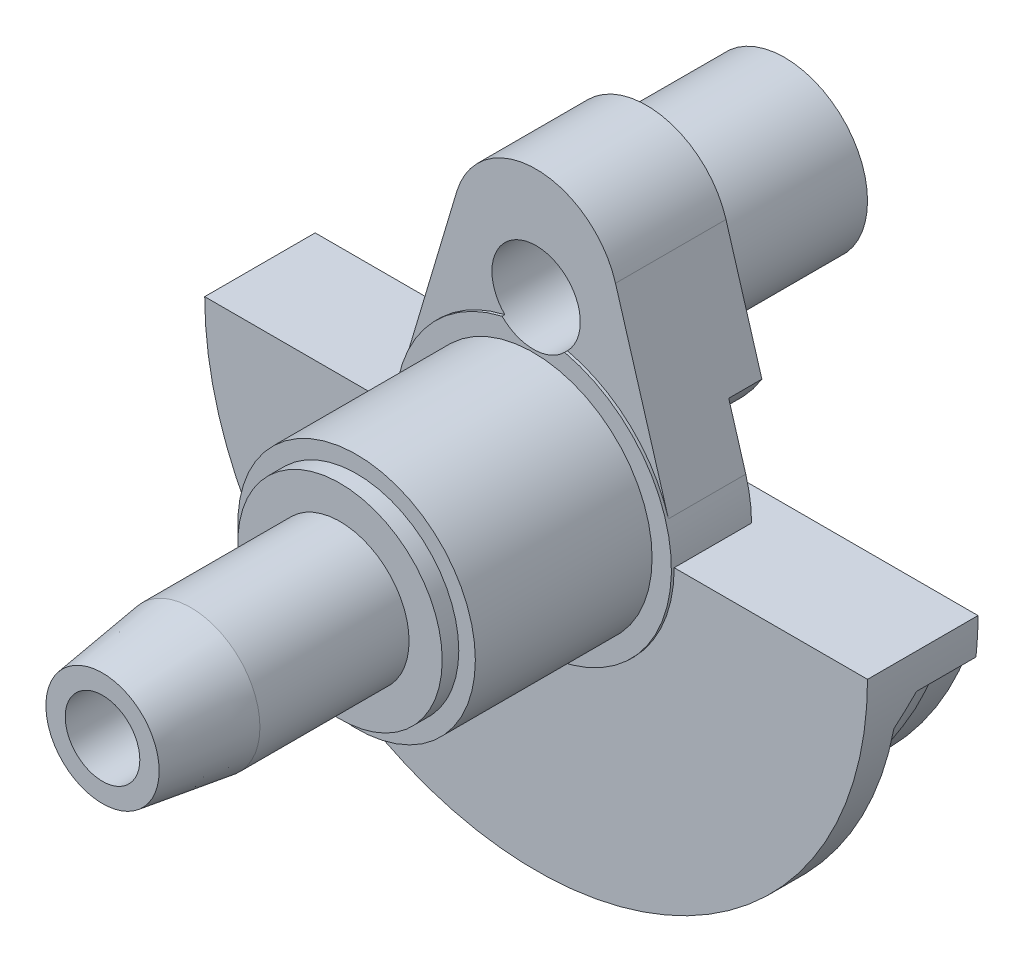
ISO-10303-21;
HEADER;
FILE_DESCRIPTION(('STEP AP214'),'2;1');
FILE_NAME('part.step','',(''),(''),'','','');
FILE_SCHEMA(('AUTOMOTIVE_DESIGN { 1 0 10303 214 1 1 1 1 }'));
ENDSEC;
DATA;
#1=APPLICATION_CONTEXT('core data for automotive mechanical design processes');
#2=APPLICATION_PROTOCOL_DEFINITION('international standard','automotive_design',2000,#1);
#3=PRODUCT_CONTEXT('',#1,'mechanical');
#4=PRODUCT('Part','Part','',(#3));
#5=PRODUCT_RELATED_PRODUCT_CATEGORY('part','',(#4));
#6=PRODUCT_DEFINITION_FORMATION('','',#4);
#7=PRODUCT_DEFINITION_CONTEXT('part definition',#1,'design');
#8=PRODUCT_DEFINITION('design','',#6,#7);
#9=PRODUCT_DEFINITION_SHAPE('','',#8);
#10=(LENGTH_UNIT() NAMED_UNIT(*) SI_UNIT(.MILLI.,.METRE.));
#11=(NAMED_UNIT(*) PLANE_ANGLE_UNIT() SI_UNIT($,.RADIAN.));
#12=(NAMED_UNIT(*) SI_UNIT($,.STERADIAN.) SOLID_ANGLE_UNIT());
#13=UNCERTAINTY_MEASURE_WITH_UNIT(LENGTH_MEASURE(1.E-05),#10,'distance_accuracy_value','');
#14=(GEOMETRIC_REPRESENTATION_CONTEXT(3) GLOBAL_UNCERTAINTY_ASSIGNED_CONTEXT((#13)) GLOBAL_UNIT_ASSIGNED_CONTEXT((#10,
#11,#12)) REPRESENTATION_CONTEXT('',''));
#15=CARTESIAN_POINT('',(0.,0.,0.));
#16=DIRECTION('',(0.,0.,1.));
#17=DIRECTION('',(1.,0.,0.));
#18=AXIS2_PLACEMENT_3D('',#15,#16,#17);
#19=CARTESIAN_POINT('',(0.,0.,-40.));
#20=DIRECTION('',(0.,0.,1.));
#21=DIRECTION('',(1.,0.,0.));
#22=AXIS2_PLACEMENT_3D('',#19,#20,#21);
#23=PLANE('',#22);
#24=CARTESIAN_POINT('',(0.,60.,-40.));
#25=DIRECTION('',(0.,0.,1.));
#26=DIRECTION('',(1.,0.,0.));
#27=AXIS2_PLACEMENT_3D('',#24,#25,#26);
#28=CIRCLE('',#27,30.);
#29=CARTESIAN_POINT('',(30.,60.,-40.));
#30=VERTEX_POINT('',#29);
#31=EDGE_CURVE('E314',#30,#30,#28,.F.);
#32=ORIENTED_EDGE('',*,*,#31,.F.);
#33=EDGE_LOOP('',(#32));
#34=FACE_BOUND('',#33,.T.);
#35=DIRECTION('',(-0.285714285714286,0.95831484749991,0.));
#36=VECTOR('',#35,1.);
#37=CARTESIAN_POINT('',(47.9157423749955,14.2857142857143,-40.));
#38=LINE('',#37,#36);
#39=CARTESIAN_POINT('',(41.7399355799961,35.,-40.));
#40=VERTEX_POINT('',#39);
#41=CARTESIAN_POINT('',(28.7494454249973,78.5714285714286,-40.));
#42=VERTEX_POINT('',#41);
#43=EDGE_CURVE('E259',#40,#42,#38,.T.);
#44=ORIENTED_EDGE('',*,*,#43,.F.);
#45=CARTESIAN_POINT('',(0.,60.,-40.));
#46=DIRECTION('',(0.,0.,1.));
#47=DIRECTION('',(-1.,0.,0.));
#48=AXIS2_PLACEMENT_3D('',#45,#46,#47);
#49=CIRCLE('',#48,48.6541079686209);
#50=CARTESIAN_POINT('',(-41.7399355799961,35.,-40.));
#51=VERTEX_POINT('',#50);
#52=EDGE_CURVE('E159',#51,#40,#49,.T.);
#53=ORIENTED_EDGE('',*,*,#52,.F.);
#54=DIRECTION('',(0.285714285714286,0.95831484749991,0.));
#55=VECTOR('',#54,1.);
#56=CARTESIAN_POINT('',(-47.9157423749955,14.2857142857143,-40.));
#57=LINE('',#56,#55);
#58=CARTESIAN_POINT('',(-28.7494454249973,78.5714285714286,-40.));
#59=VERTEX_POINT('',#58);
#60=EDGE_CURVE('E265',#51,#59,#57,.T.);
#61=ORIENTED_EDGE('',*,*,#60,.T.);
#62=CARTESIAN_POINT('',(0.,70.,-40.));
#63=DIRECTION('',(0.,0.,1.));
#64=DIRECTION('',(1.,0.,0.));
#65=AXIS2_PLACEMENT_3D('',#62,#63,#64);
#66=CIRCLE('',#65,30.);
#67=EDGE_CURVE('E261',#42,#59,#66,.T.);
#68=ORIENTED_EDGE('',*,*,#67,.F.);
#69=EDGE_LOOP('',(#44,#53,#61,#68));
#70=FACE_BOUND('',#69,.T.);
#71=ADVANCED_FACE('F35',(#34,#70),#23,.F.);
#72=CARTESIAN_POINT('',(0.,0.,-40.));
#73=DIRECTION('',(0.,0.,1.));
#74=DIRECTION('',(1.,0.,0.));
#75=AXIS2_PLACEMENT_3D('',#72,#73,#74);
#76=CYLINDRICAL_SURFACE('',#75,50.);
#77=DIRECTION('',(0.,0.,1.));
#78=VECTOR('',#77,1.);
#79=CARTESIAN_POINT('',(50.,0.,-308.328157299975));
#80=LINE('',#79,#78);
#81=CARTESIAN_POINT('',(50.,0.,-28.));
#82=VERTEX_POINT('',#81);
#83=CARTESIAN_POINT('',(50.,0.,0.));
#84=VERTEX_POINT('',#83);
#85=EDGE_CURVE('E309',#82,#84,#80,.T.);
#86=ORIENTED_EDGE('',*,*,#85,.F.);
#87=CARTESIAN_POINT('',(0.,0.,-28.));
#88=DIRECTION('',(0.,0.,-1.));
#89=DIRECTION('',(-1.,0.,0.));
#90=AXIS2_PLACEMENT_3D('',#87,#88,#89);
#91=CIRCLE('',#90,50.);
#92=CARTESIAN_POINT('',(47.9157423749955,14.2857142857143,-28.));
#93=VERTEX_POINT('',#92);
#94=EDGE_CURVE('E176',#93,#82,#91,.T.);
#95=ORIENTED_EDGE('',*,*,#94,.F.);
#96=DIRECTION('',(0.,0.,1.));
#97=VECTOR('',#96,1.);
#98=CARTESIAN_POINT('',(47.9157423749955,14.2857142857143,-308.328157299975));
#99=LINE('',#98,#97);
#100=CARTESIAN_POINT('',(47.9157423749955,14.2857142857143,0.));
#101=VERTEX_POINT('',#100);
#102=EDGE_CURVE('E175',#93,#101,#99,.T.);
#103=ORIENTED_EDGE('',*,*,#102,.T.);
#104=CARTESIAN_POINT('',(0.,0.,0.));
#105=DIRECTION('',(0.,0.,1.));
#106=DIRECTION('',(1.,0.,0.));
#107=AXIS2_PLACEMENT_3D('',#104,#105,#106);
#108=CIRCLE('',#107,50.);
#109=CARTESIAN_POINT('',(11.3274004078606,48.7,0.));
#110=VERTEX_POINT('',#109);
#111=EDGE_CURVE('E272',#101,#110,#108,.T.);
#112=ORIENTED_EDGE('',*,*,#111,.T.);
#113=DIRECTION('',(0.,0.,-1.));
#114=VECTOR('',#113,1.);
#115=CARTESIAN_POINT('',(11.3274004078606,48.7,-19.5));
#116=LINE('',#115,#114);
#117=CARTESIAN_POINT('',(11.3274004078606,48.7,1.));
#118=VERTEX_POINT('',#117);
#119=EDGE_CURVE('E221',#118,#110,#116,.T.);
#120=ORIENTED_EDGE('',*,*,#119,.F.);
#121=CARTESIAN_POINT('',(0.,0.,1.));
#122=DIRECTION('',(0.,0.,1.));
#123=DIRECTION('',(1.,0.,0.));
#124=AXIS2_PLACEMENT_3D('',#121,#122,#123);
#125=CIRCLE('',#124,50.);
#126=CARTESIAN_POINT('',(-11.3274004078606,48.7,1.));
#127=VERTEX_POINT('',#126);
#128=EDGE_CURVE('E293',#127,#118,#125,.T.);
#129=ORIENTED_EDGE('',*,*,#128,.F.);
#130=DIRECTION('',(0.,0.,-1.));
#131=VECTOR('',#130,1.);
#132=CARTESIAN_POINT('',(-11.3274004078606,48.7,-19.5));
#133=LINE('',#132,#131);
#134=CARTESIAN_POINT('',(-11.3274004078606,48.7,0.));
#135=VERTEX_POINT('',#134);
#136=EDGE_CURVE('E223',#135,#127,#133,.F.);
#137=ORIENTED_EDGE('',*,*,#136,.F.);
#138=CARTESIAN_POINT('',(-47.9157423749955,14.2857142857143,0.));
#139=VERTEX_POINT('',#138);
#140=EDGE_CURVE('E271',#135,#139,#108,.T.);
#141=ORIENTED_EDGE('',*,*,#140,.T.);
#142=DIRECTION('',(0.,0.,1.));
#143=VECTOR('',#142,1.);
#144=CARTESIAN_POINT('',(-47.9157423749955,14.2857142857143,-308.328157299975));
#145=LINE('',#144,#143);
#146=CARTESIAN_POINT('',(-47.9157423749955,14.2857142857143,-28.));
#147=VERTEX_POINT('',#146);
#148=EDGE_CURVE('E280',#147,#139,#145,.T.);
#149=ORIENTED_EDGE('',*,*,#148,.F.);
#150=CARTESIAN_POINT('',(0.,0.,-28.));
#151=DIRECTION('',(0.,0.,-1.));
#152=DIRECTION('',(-1.,0.,0.));
#153=AXIS2_PLACEMENT_3D('',#150,#151,#152);
#154=CIRCLE('',#153,50.);
#155=CARTESIAN_POINT('',(-50.,0.,-28.));
#156=VERTEX_POINT('',#155);
#157=EDGE_CURVE('E50',#156,#147,#154,.T.);
#158=ORIENTED_EDGE('',*,*,#157,.F.);
#159=DIRECTION('',(0.,0.,1.));
#160=VECTOR('',#159,1.);
#161=CARTESIAN_POINT('',(-50.,0.,-308.328157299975));
#162=LINE('',#161,#160);
#163=CARTESIAN_POINT('',(-50.,0.,0.));
#164=VERTEX_POINT('',#163);
#165=EDGE_CURVE('E307',#156,#164,#162,.T.);
#166=ORIENTED_EDGE('',*,*,#165,.T.);
#167=CARTESIAN_POINT('',(0.,0.,0.));
#168=DIRECTION('',(0.,0.,1.));
#169=DIRECTION('',(1.,0.,0.));
#170=AXIS2_PLACEMENT_3D('',#167,#168,#169);
#171=CIRCLE('',#170,50.);
#172=EDGE_CURVE('E299',#164,#84,#171,.T.);
#173=ORIENTED_EDGE('',*,*,#172,.T.);
#174=EDGE_LOOP('',(#86,#95,#103,#112,#120,#129,#137,#141,#149,#158,#166,#173));
#175=FACE_BOUND('',#174,.T.);
#176=ADVANCED_FACE('F37',(#175),#76,.T.);
#177=DIRECTION('',(-1.,0.,0.));
#178=VECTOR('',#177,1.);
#179=CARTESIAN_POINT('',(0.,0.,-40.));
#180=LINE('',#179,#178);
#181=CARTESIAN_POINT('',(120.,0.,-40.));
#182=VERTEX_POINT('',#181);
#183=CARTESIAN_POINT('',(-120.,0.,-40.));
#184=VERTEX_POINT('',#183);
#185=EDGE_CURVE('E285',#182,#184,#180,.T.);
#186=ORIENTED_EDGE('',*,*,#185,.F.);
#187=CARTESIAN_POINT('',(0.,0.,-40.));
#188=DIRECTION('',(0.,0.,1.));
#189=DIRECTION('',(1.,0.,0.));
#190=AXIS2_PLACEMENT_3D('',#187,#188,#189);
#191=CIRCLE('',#190,120.);
#192=CARTESIAN_POINT('',(119.249134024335,-13.4031352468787,-40.));
#193=VERTEX_POINT('',#192);
#194=EDGE_CURVE('E288',#193,#182,#191,.T.);
#195=ORIENTED_EDGE('',*,*,#194,.F.);
#196=DIRECTION('',(-0.93969262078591,0.342020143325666,0.));
#197=VECTOR('',#196,1.);
#198=CARTESIAN_POINT('',(140.953893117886,-21.3030214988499,-40.));
#199=LINE('',#198,#197);
#200=CARTESIAN_POINT('',(116.521884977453,-12.4104977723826,-40.));
#201=VERTEX_POINT('',#200);
#202=EDGE_CURVE('E58',#193,#201,#199,.T.);
#203=ORIENTED_EDGE('',*,*,#202,.T.);
#204=CARTESIAN_POINT('',(0.,30.,-40.));
#205=DIRECTION('',(0.,0.,1.));
#206=DIRECTION('',(1.,0.,0.));
#207=AXIS2_PLACEMENT_3D('',#204,#205,#206);
#208=CIRCLE('',#207,124.);
#209=CARTESIAN_POINT('',(-116.521884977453,-12.4104977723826,-40.));
#210=VERTEX_POINT('',#209);
#211=EDGE_CURVE('E206',#210,#201,#208,.T.);
#212=ORIENTED_EDGE('',*,*,#211,.F.);
#213=DIRECTION('',(0.93969262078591,0.342020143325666,0.));
#214=VECTOR('',#213,1.);
#215=CARTESIAN_POINT('',(-140.953893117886,-21.3030214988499,-40.));
#216=LINE('',#215,#214);
#217=CARTESIAN_POINT('',(-119.249134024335,-13.4031352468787,-40.));
#218=VERTEX_POINT('',#217);
#219=EDGE_CURVE('E193',#218,#210,#216,.T.);
#220=ORIENTED_EDGE('',*,*,#219,.F.);
#221=EDGE_CURVE('E290',#184,#218,#191,.T.);
#222=ORIENTED_EDGE('',*,*,#221,.F.);
#223=EDGE_LOOP('',(#186,#195,#203,#212,#220,#222));
#224=FACE_BOUND('',#223,.T.);
#225=ADVANCED_FACE('F364',(#224),#23,.F.);
#226=CARTESIAN_POINT('',(0.,0.,-308.328157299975));
#227=DIRECTION('',(0.,0.,1.));
#228=DIRECTION('',(1.,0.,0.));
#229=AXIS2_PLACEMENT_3D('',#226,#227,#228);
#230=CYLINDRICAL_SURFACE('',#229,120.);
#231=DIRECTION('',(0.,0.,1.));
#232=VECTOR('',#231,1.);
#233=CARTESIAN_POINT('',(-119.249134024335,-13.4031352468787,-308.328157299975));
#234=LINE('',#233,#232);
#235=CARTESIAN_POINT('',(-119.249134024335,-13.4031352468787,-18.5070770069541));
#236=VERTEX_POINT('',#235);
#237=EDGE_CURVE('E11',#236,#218,#234,.F.);
#238=ORIENTED_EDGE('',*,*,#237,.F.);
#239=CARTESIAN_POINT('',(-119.356543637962,-12.4102977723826,-19.2754872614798));
#240=CARTESIAN_POINT('',(-119.270393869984,-13.2388434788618,-18.6336360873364));
#241=CARTESIAN_POINT('',(-119.175507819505,-14.0675458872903,-17.9931560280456));
#242=CARTESIAN_POINT('',(-118.968186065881,-15.724752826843,-16.7152914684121));
#243=CARTESIAN_POINT('',(-118.855755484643,-16.5532573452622,-16.0779061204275));
#244=CARTESIAN_POINT('',(-118.613217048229,-18.2100434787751,-14.8062076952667));
#245=CARTESIAN_POINT('',(-118.483109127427,-19.0383250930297,-14.1718946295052));
#246=CARTESIAN_POINT('',(-118.205067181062,-20.6946233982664,-12.9063296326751));
#247=CARTESIAN_POINT('',(-118.057127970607,-21.5226399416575,-12.2750786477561));
#248=CARTESIAN_POINT('',(-117.900236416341,-22.3502629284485,-11.6455369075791));
#249=B_SPLINE_CURVE_WITH_KNOTS('',3,(#239,#240,#241,#242,#243,#244,#245,#246,#247,#248),
.UNSPECIFIED.,.F.,.F.,(4,2,2,2,4),(0.,3.15479483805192,6.30867039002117,9.46255765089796,
12.6173642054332),.UNSPECIFIED.);
#250=CARTESIAN_POINT('',(-117.900286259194,-22.3500000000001,-11.6457369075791));
#251=VERTEX_POINT('',#250);
#252=EDGE_CURVE('E43',#236,#251,#249,.T.);
#253=ORIENTED_EDGE('',*,*,#252,.T.);
#254=CARTESIAN_POINT('',(0.,0.,-11.6457369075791));
#255=DIRECTION('',(0.,0.,1.));
#256=DIRECTION('',(1.,0.,0.));
#257=AXIS2_PLACEMENT_3D('',#254,#255,#256);
#258=CIRCLE('',#257,120.);
#259=CARTESIAN_POINT('',(117.900286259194,-22.3500000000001,-11.6457369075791));
#260=VERTEX_POINT('',#259);
#261=EDGE_CURVE('E331',#251,#260,#258,.T.);
#262=ORIENTED_EDGE('',*,*,#261,.T.);
#263=CARTESIAN_POINT('',(117.900236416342,-22.3502629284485,-11.6455369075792));
#264=CARTESIAN_POINT('',(118.057127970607,-21.5226399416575,-12.2750786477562));
#265=CARTESIAN_POINT('',(118.205067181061,-20.6946233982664,-12.9063296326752));
#266=CARTESIAN_POINT('',(118.483109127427,-19.0383250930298,-14.1718946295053));
#267=CARTESIAN_POINT('',(118.613217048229,-18.2100434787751,-14.8062076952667));
#268=CARTESIAN_POINT('',(118.855755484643,-16.5532573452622,-16.0779061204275));
#269=CARTESIAN_POINT('',(118.968186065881,-15.724752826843,-16.7152914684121));
#270=CARTESIAN_POINT('',(119.175507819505,-14.0675458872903,-17.9931560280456));
#271=CARTESIAN_POINT('',(119.270393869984,-13.2388434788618,-18.6336360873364));
#272=CARTESIAN_POINT('',(119.356543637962,-12.4102977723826,-19.2754872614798));
#273=B_SPLINE_CURVE_WITH_KNOTS('',3,(#263,#264,#265,#266,#267,#268,#269,#270,#271,#272),
.UNSPECIFIED.,.F.,.F.,(4,2,2,2,4),(0.,3.15480655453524,6.30869381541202,9.46256936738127,
12.6173642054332),.UNSPECIFIED.);
#274=CARTESIAN_POINT('',(119.249134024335,-13.4031352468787,-18.5070770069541));
#275=VERTEX_POINT('',#274);
#276=EDGE_CURVE('E323',#260,#275,#273,.T.);
#277=ORIENTED_EDGE('',*,*,#276,.T.);
#278=DIRECTION('',(0.,0.,1.));
#279=VECTOR('',#278,1.);
#280=CARTESIAN_POINT('',(119.249134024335,-13.4031352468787,-308.328157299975));
#281=LINE('',#280,#279);
#282=EDGE_CURVE('E321',#275,#193,#281,.F.);
#283=ORIENTED_EDGE('',*,*,#282,.T.);
#284=ORIENTED_EDGE('',*,*,#194,.T.);
#285=DIRECTION('',(0.,0.,1.));
#286=VECTOR('',#285,1.);
#287=CARTESIAN_POINT('',(120.,0.,-308.328157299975));
#288=LINE('',#287,#286);
#289=CARTESIAN_POINT('',(120.,0.,0.));
#290=VERTEX_POINT('',#289);
#291=EDGE_CURVE('E305',#182,#290,#288,.T.);
#292=ORIENTED_EDGE('',*,*,#291,.T.);
#293=CARTESIAN_POINT('',(0.,0.,0.));
#294=DIRECTION('',(0.,0.,1.));
#295=DIRECTION('',(1.,0.,0.));
#296=AXIS2_PLACEMENT_3D('',#293,#294,#295);
#297=CIRCLE('',#296,120.);
#298=CARTESIAN_POINT('',(-120.,0.,0.));
#299=VERTEX_POINT('',#298);
#300=EDGE_CURVE('E284',#290,#299,#297,.F.);
#301=ORIENTED_EDGE('',*,*,#300,.T.);
#302=DIRECTION('',(0.,0.,1.));
#303=VECTOR('',#302,1.);
#304=CARTESIAN_POINT('',(-120.,0.,-308.328157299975));
#305=LINE('',#304,#303);
#306=EDGE_CURVE('E289',#184,#299,#305,.T.);
#307=ORIENTED_EDGE('',*,*,#306,.F.);
#308=ORIENTED_EDGE('',*,*,#221,.T.);
#309=EDGE_LOOP('',(#238,#253,#262,#277,#283,#284,#292,#301,#307,#308));
#310=FACE_BOUND('',#309,.T.);
#311=ADVANCED_FACE('F332',(#310),#230,.T.);
#312=CARTESIAN_POINT('',(0.,0.,1.));
#313=DIRECTION('',(0.,0.,1.));
#314=DIRECTION('',(1.,0.,0.));
#315=AXIS2_PLACEMENT_3D('',#312,#313,#314);
#316=PLANE('',#315);
#317=CARTESIAN_POINT('',(0.,60.,1.));
#318=DIRECTION('',(0.,0.,1.));
#319=DIRECTION('',(1.,0.,0.));
#320=AXIS2_PLACEMENT_3D('',#317,#318,#319);
#321=CIRCLE('',#320,16.);
#322=EDGE_CURVE('E217',#118,#127,#321,.F.);
#323=ORIENTED_EDGE('',*,*,#322,.T.);
#324=ORIENTED_EDGE('',*,*,#128,.T.);
#325=EDGE_LOOP('',(#323,#324));
#326=FACE_BOUND('',#325,.T.);
#327=CARTESIAN_POINT('',(0.,0.,1.00000000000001));
#328=DIRECTION('',(0.,0.,1.));
#329=DIRECTION('',(1.,0.,0.));
#330=AXIS2_PLACEMENT_3D('',#327,#328,#329);
#331=CIRCLE('',#330,43.);
#332=CARTESIAN_POINT('',(43.,0.,1.00000000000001));
#333=VERTEX_POINT('',#332);
#334=EDGE_CURVE('E255',#333,#333,#331,.T.);
#335=ORIENTED_EDGE('',*,*,#334,.F.);
#336=EDGE_LOOP('',(#335));
#337=FACE_BOUND('',#336,.T.);
#338=ADVANCED_FACE('F421',(#326,#337),#316,.T.);
#339=CARTESIAN_POINT('',(0.,0.,-308.328157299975));
#340=DIRECTION('',(0.,-1.,0.));
#341=DIRECTION('',(0.,0.,-1.));
#342=AXIS2_PLACEMENT_3D('',#339,#340,#341);
#343=PLANE('',#342);
#344=ORIENTED_EDGE('',*,*,#165,.F.);
#345=DIRECTION('',(-1.,0.,0.));
#346=VECTOR('',#345,1.);
#347=CARTESIAN_POINT('',(50.,0.,-28.));
#348=LINE('',#347,#346);
#349=EDGE_CURVE('E178',#82,#156,#348,.T.);
#350=ORIENTED_EDGE('',*,*,#349,.F.);
#351=ORIENTED_EDGE('',*,*,#85,.T.);
#352=DIRECTION('',(-1.,0.,0.));
#353=VECTOR('',#352,1.);
#354=CARTESIAN_POINT('',(0.,0.,0.));
#355=LINE('',#354,#353);
#356=EDGE_CURVE('E296',#290,#84,#355,.T.);
#357=ORIENTED_EDGE('',*,*,#356,.F.);
#358=ORIENTED_EDGE('',*,*,#291,.F.);
#359=ORIENTED_EDGE('',*,*,#185,.T.);
#360=ORIENTED_EDGE('',*,*,#306,.T.);
#361=DIRECTION('',(1.,0.,0.));
#362=VECTOR('',#361,1.);
#363=CARTESIAN_POINT('',(0.,0.,0.));
#364=LINE('',#363,#362);
#365=EDGE_CURVE('E302',#299,#164,#364,.T.);
#366=ORIENTED_EDGE('',*,*,#365,.T.);
#367=EDGE_LOOP('',(#344,#350,#351,#357,#358,#359,#360,#366));
#368=FACE_BOUND('',#367,.T.);
#369=ADVANCED_FACE('F370',(#368),#343,.F.);
#370=CARTESIAN_POINT('',(0.,0.,0.));
#371=DIRECTION('',(0.,0.,1.));
#372=DIRECTION('',(1.,0.,0.));
#373=AXIS2_PLACEMENT_3D('',#370,#371,#372);
#374=PLANE('',#373);
#375=ORIENTED_EDGE('',*,*,#300,.F.);
#376=ORIENTED_EDGE('',*,*,#356,.T.);
#377=ORIENTED_EDGE('',*,*,#172,.F.);
#378=ORIENTED_EDGE('',*,*,#365,.F.);
#379=EDGE_LOOP('',(#375,#376,#377,#378));
#380=FACE_BOUND('',#379,.T.);
#381=ADVANCED_FACE('F375',(#380),#374,.T.);
#382=CARTESIAN_POINT('',(0.,70.,-308.328157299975));
#383=DIRECTION('',(0.,0.,1.));
#384=DIRECTION('',(1.,0.,0.));
#385=AXIS2_PLACEMENT_3D('',#382,#383,#384);
#386=CYLINDRICAL_SURFACE('',#385,30.);
#387=DIRECTION('',(0.,0.,1.));
#388=VECTOR('',#387,1.);
#389=CARTESIAN_POINT('',(28.7494454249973,78.5714285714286,-308.328157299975));
#390=LINE('',#389,#388);
#391=CARTESIAN_POINT('',(28.7494454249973,78.5714285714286,0.));
#392=VERTEX_POINT('',#391);
#393=EDGE_CURVE('E262',#42,#392,#390,.T.);
#394=ORIENTED_EDGE('',*,*,#393,.F.);
#395=ORIENTED_EDGE('',*,*,#67,.T.);
#396=DIRECTION('',(0.,0.,1.));
#397=VECTOR('',#396,1.);
#398=CARTESIAN_POINT('',(-28.7494454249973,78.5714285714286,-308.328157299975));
#399=LINE('',#398,#397);
#400=CARTESIAN_POINT('',(-28.7494454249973,78.5714285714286,0.));
#401=VERTEX_POINT('',#400);
#402=EDGE_CURVE('E277',#59,#401,#399,.T.);
#403=ORIENTED_EDGE('',*,*,#402,.T.);
#404=CARTESIAN_POINT('',(0.,70.,0.));
#405=DIRECTION('',(0.,0.,1.));
#406=DIRECTION('',(1.,0.,0.));
#407=AXIS2_PLACEMENT_3D('',#404,#405,#406);
#408=CIRCLE('',#407,30.);
#409=EDGE_CURVE('E258',#401,#392,#408,.F.);
#410=ORIENTED_EDGE('',*,*,#409,.T.);
#411=EDGE_LOOP('',(#394,#395,#403,#410));
#412=FACE_BOUND('',#411,.T.);
#413=ADVANCED_FACE('F398',(#412),#386,.T.);
#414=CARTESIAN_POINT('',(47.9157423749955,14.2857142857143,-308.328157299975));
#415=DIRECTION('',(-0.95831484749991,-0.285714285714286,0.));
#416=DIRECTION('',(0.285714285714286,-0.95831484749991,0.));
#417=AXIS2_PLACEMENT_3D('',#414,#415,#416);
#418=PLANE('',#417);
#419=DIRECTION('',(0.285714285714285,-0.95831484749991,0.));
#420=VECTOR('',#419,1.);
#421=CARTESIAN_POINT('',(41.7399355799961,35.,-28.));
#422=LINE('',#421,#420);
#423=CARTESIAN_POINT('',(41.7399355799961,35.,-28.));
#424=VERTEX_POINT('',#423);
#425=EDGE_CURVE('E168',#424,#93,#422,.T.);
#426=ORIENTED_EDGE('',*,*,#425,.F.);
#427=DIRECTION('',(0.,0.,-1.));
#428=VECTOR('',#427,1.);
#429=CARTESIAN_POINT('',(41.7399355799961,35.,-28.));
#430=LINE('',#429,#428);
#431=EDGE_CURVE('E154',#424,#40,#430,.T.);
#432=ORIENTED_EDGE('',*,*,#431,.T.);
#433=ORIENTED_EDGE('',*,*,#43,.T.);
#434=ORIENTED_EDGE('',*,*,#393,.T.);
#435=DIRECTION('',(0.285714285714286,-0.95831484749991,0.));
#436=VECTOR('',#435,1.);
#437=CARTESIAN_POINT('',(47.9157423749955,14.2857142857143,0.));
#438=LINE('',#437,#436);
#439=EDGE_CURVE('E275',#392,#101,#438,.T.);
#440=ORIENTED_EDGE('',*,*,#439,.T.);
#441=ORIENTED_EDGE('',*,*,#102,.F.);
#442=EDGE_LOOP('',(#426,#432,#433,#434,#440,#441));
#443=FACE_BOUND('',#442,.T.);
#444=ADVANCED_FACE('F173',(#443),#418,.F.);
#445=CARTESIAN_POINT('',(-47.9157423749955,14.2857142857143,-308.328157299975));
#446=DIRECTION('',(-0.95831484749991,0.285714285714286,0.));
#447=DIRECTION('',(-0.285714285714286,-0.95831484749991,0.));
#448=AXIS2_PLACEMENT_3D('',#445,#446,#447);
#449=PLANE('',#448);
#450=DIRECTION('',(0.,0.,-1.));
#451=VECTOR('',#450,1.);
#452=CARTESIAN_POINT('',(-41.7399355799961,35.,-28.));
#453=LINE('',#452,#451);
#454=CARTESIAN_POINT('',(-41.7399355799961,35.,-28.));
#455=VERTEX_POINT('',#454);
#456=EDGE_CURVE('E163',#455,#51,#453,.T.);
#457=ORIENTED_EDGE('',*,*,#456,.F.);
#458=DIRECTION('',(0.285714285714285,0.95831484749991,0.));
#459=VECTOR('',#458,1.);
#460=CARTESIAN_POINT('',(-41.7399355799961,35.,-28.));
#461=LINE('',#460,#459);
#462=EDGE_CURVE('E164',#147,#455,#461,.T.);
#463=ORIENTED_EDGE('',*,*,#462,.F.);
#464=ORIENTED_EDGE('',*,*,#148,.T.);
#465=DIRECTION('',(-0.285714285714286,-0.95831484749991,0.));
#466=VECTOR('',#465,1.);
#467=CARTESIAN_POINT('',(-47.9157423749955,14.2857142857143,0.));
#468=LINE('',#467,#466);
#469=EDGE_CURVE('E268',#401,#139,#468,.T.);
#470=ORIENTED_EDGE('',*,*,#469,.F.);
#471=ORIENTED_EDGE('',*,*,#402,.F.);
#472=ORIENTED_EDGE('',*,*,#60,.F.);
#473=EDGE_LOOP('',(#457,#463,#464,#470,#471,#472));
#474=FACE_BOUND('',#473,.T.);
#475=ADVANCED_FACE('F385',(#474),#449,.T.);
#476=CARTESIAN_POINT('',(0.,0.,0.));
#477=DIRECTION('',(0.,0.,1.));
#478=DIRECTION('',(1.,0.,0.));
#479=AXIS2_PLACEMENT_3D('',#476,#477,#478);
#480=PLANE('',#479);
#481=CARTESIAN_POINT('',(0.,60.,0.));
#482=DIRECTION('',(0.,0.,1.));
#483=DIRECTION('',(1.,0.,0.));
#484=AXIS2_PLACEMENT_3D('',#481,#482,#483);
#485=CIRCLE('',#484,16.);
#486=EDGE_CURVE('E317',#110,#135,#485,.T.);
#487=ORIENTED_EDGE('',*,*,#486,.F.);
#488=ORIENTED_EDGE('',*,*,#111,.F.);
#489=ORIENTED_EDGE('',*,*,#439,.F.);
#490=ORIENTED_EDGE('',*,*,#409,.F.);
#491=ORIENTED_EDGE('',*,*,#469,.T.);
#492=ORIENTED_EDGE('',*,*,#140,.F.);
#493=EDGE_LOOP('',(#487,#488,#489,#490,#491,#492));
#494=FACE_BOUND('',#493,.T.);
#495=ADVANCED_FACE('F397',(#494),#480,.T.);
#496=CARTESIAN_POINT('',(0.,0.,125.));
#497=DIRECTION('',(0.,0.,1.));
#498=DIRECTION('',(1.,0.,0.));
#499=AXIS2_PLACEMENT_3D('',#496,#497,#498);
#500=CYLINDRICAL_SURFACE('',#499,43.);
#501=CARTESIAN_POINT('',(0.,0.,65.));
#502=DIRECTION('',(0.,0.,1.));
#503=DIRECTION('',(1.,0.,0.));
#504=AXIS2_PLACEMENT_3D('',#501,#502,#503);
#505=CIRCLE('',#504,43.);
#506=CARTESIAN_POINT('',(43.,0.,65.));
#507=VERTEX_POINT('',#506);
#508=EDGE_CURVE('E252',#507,#507,#505,.T.);
#509=ORIENTED_EDGE('',*,*,#508,.F.);
#510=EDGE_LOOP('',(#509));
#511=FACE_BOUND('',#510,.T.);
#512=ORIENTED_EDGE('',*,*,#334,.T.);
#513=EDGE_LOOP('',(#512));
#514=FACE_BOUND('',#513,.T.);
#515=ADVANCED_FACE('F437',(#511,#514),#500,.T.);
#516=CARTESIAN_POINT('',(0.,43.,65.));
#517=DIRECTION('',(0.,0.,-1.));
#518=DIRECTION('',(-1.,0.,0.));
#519=AXIS2_PLACEMENT_3D('',#516,#517,#518);
#520=PLANE('',#519);
#521=CARTESIAN_POINT('',(0.,0.,65.));
#522=DIRECTION('',(0.,0.,1.));
#523=DIRECTION('',(1.,0.,0.));
#524=AXIS2_PLACEMENT_3D('',#521,#522,#523);
#525=CIRCLE('',#524,37.);
#526=CARTESIAN_POINT('',(37.,0.,65.));
#527=VERTEX_POINT('',#526);
#528=EDGE_CURVE('E249',#527,#527,#525,.T.);
#529=ORIENTED_EDGE('',*,*,#528,.F.);
#530=EDGE_LOOP('',(#529));
#531=FACE_BOUND('',#530,.T.);
#532=ORIENTED_EDGE('',*,*,#508,.T.);
#533=EDGE_LOOP('',(#532));
#534=FACE_BOUND('',#533,.T.);
#535=ADVANCED_FACE('F439',(#531,#534),#520,.F.);
#536=CARTESIAN_POINT('',(0.,0.,125.));
#537=DIRECTION('',(0.,0.,1.));
#538=DIRECTION('',(1.,0.,0.));
#539=AXIS2_PLACEMENT_3D('',#536,#537,#538);
#540=CYLINDRICAL_SURFACE('',#539,37.);
#541=CARTESIAN_POINT('',(0.,0.,71.));
#542=DIRECTION('',(0.,0.,1.));
#543=DIRECTION('',(1.,0.,0.));
#544=AXIS2_PLACEMENT_3D('',#541,#542,#543);
#545=CIRCLE('',#544,37.);
#546=CARTESIAN_POINT('',(37.,0.,71.));
#547=VERTEX_POINT('',#546);
#548=EDGE_CURVE('E246',#547,#547,#545,.T.);
#549=ORIENTED_EDGE('',*,*,#548,.F.);
#550=EDGE_LOOP('',(#549));
#551=FACE_BOUND('',#550,.T.);
#552=ORIENTED_EDGE('',*,*,#528,.T.);
#553=EDGE_LOOP('',(#552));
#554=FACE_BOUND('',#553,.T.);
#555=ADVANCED_FACE('F446',(#551,#554),#540,.T.);
#556=CARTESIAN_POINT('',(0.,37.,71.));
#557=DIRECTION('',(0.,0.,-1.));
#558=DIRECTION('',(-1.,0.,0.));
#559=AXIS2_PLACEMENT_3D('',#556,#557,#558);
#560=PLANE('',#559);
#561=CARTESIAN_POINT('',(0.,0.,71.));
#562=DIRECTION('',(0.,0.,1.));
#563=DIRECTION('',(1.,0.,0.));
#564=AXIS2_PLACEMENT_3D('',#561,#562,#563);
#565=CIRCLE('',#564,25.);
#566=CARTESIAN_POINT('',(25.,0.,71.));
#567=VERTEX_POINT('',#566);
#568=EDGE_CURVE('E243',#567,#567,#565,.T.);
#569=ORIENTED_EDGE('',*,*,#568,.F.);
#570=EDGE_LOOP('',(#569));
#571=FACE_BOUND('',#570,.T.);
#572=ORIENTED_EDGE('',*,*,#548,.T.);
#573=EDGE_LOOP('',(#572));
#574=FACE_BOUND('',#573,.T.);
#575=ADVANCED_FACE('F628',(#571,#574),#560,.F.);
#576=CARTESIAN_POINT('',(0.,0.,125.));
#577=DIRECTION('',(0.,0.,1.));
#578=DIRECTION('',(1.,0.,0.));
#579=AXIS2_PLACEMENT_3D('',#576,#577,#578);
#580=CYLINDRICAL_SURFACE('',#579,25.);
#581=CARTESIAN_POINT('',(0.,0.,125.));
#582=DIRECTION('',(0.,0.,1.));
#583=DIRECTION('',(1.,0.,0.));
#584=AXIS2_PLACEMENT_3D('',#581,#582,#583);
#585=CIRCLE('',#584,25.);
#586=CARTESIAN_POINT('',(25.,0.,125.));
#587=VERTEX_POINT('',#586);
#588=EDGE_CURVE('E240',#587,#587,#585,.T.);
#589=ORIENTED_EDGE('',*,*,#588,.F.);
#590=EDGE_LOOP('',(#589));
#591=FACE_BOUND('',#590,.T.);
#592=ORIENTED_EDGE('',*,*,#568,.T.);
#593=EDGE_LOOP('',(#592));
#594=FACE_BOUND('',#593,.T.);
#595=ADVANCED_FACE('F621',(#591,#594),#580,.T.);
#596=CARTESIAN_POINT('',(0.,0.,125.));
#597=DIRECTION('',(0.,0.,-1.));
#598=DIRECTION('',(1.,0.,0.));
#599=AXIS2_PLACEMENT_3D('',#596,#597,#598);
#600=CONICAL_SURFACE('',#599,25.,0.139626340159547);
#601=CARTESIAN_POINT('',(0.,0.,157.));
#602=DIRECTION('',(0.,0.,1.));
#603=DIRECTION('',(1.,0.,0.));
#604=AXIS2_PLACEMENT_3D('',#601,#602,#603);
#605=CIRCLE('',#604,20.5026932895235);
#606=CARTESIAN_POINT('',(20.5026932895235,0.,157.));
#607=VERTEX_POINT('',#606);
#608=EDGE_CURVE('E237',#607,#607,#605,.T.);
#609=ORIENTED_EDGE('',*,*,#608,.F.);
#610=EDGE_LOOP('',(#609));
#611=FACE_BOUND('',#610,.T.);
#612=ORIENTED_EDGE('',*,*,#588,.T.);
#613=EDGE_LOOP('',(#612));
#614=FACE_BOUND('',#613,.T.);
#615=ADVANCED_FACE('F612',(#611,#614),#600,.T.);
#616=CARTESIAN_POINT('',(0.,0.,157.));
#617=DIRECTION('',(0.,0.,1.));
#618=DIRECTION('',(1.,0.,0.));
#619=AXIS2_PLACEMENT_3D('',#616,#617,#618);
#620=PLANE('',#619);
#621=CARTESIAN_POINT('',(0.,0.,157.));
#622=DIRECTION('',(0.,0.,1.));
#623=DIRECTION('',(1.,0.,0.));
#624=AXIS2_PLACEMENT_3D('',#621,#622,#623);
#625=CIRCLE('',#624,13.5026932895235);
#626=CARTESIAN_POINT('',(13.5026932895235,0.,157.));
#627=VERTEX_POINT('',#626);
#628=EDGE_CURVE('E208',#627,#627,#625,.T.);
#629=ORIENTED_EDGE('',*,*,#628,.F.);
#630=EDGE_LOOP('',(#629));
#631=FACE_BOUND('',#630,.T.);
#632=ORIENTED_EDGE('',*,*,#608,.T.);
#633=EDGE_LOOP('',(#632));
#634=FACE_BOUND('',#633,.T.);
#635=ADVANCED_FACE('F604',(#631,#634),#620,.T.);
#636=CARTESIAN_POINT('',(0.,60.,-90.));
#637=DIRECTION('',(0.,0.,1.));
#638=DIRECTION('',(1.,0.,0.));
#639=AXIS2_PLACEMENT_3D('',#636,#637,#638);
#640=CYLINDRICAL_SURFACE('',#639,30.);
#641=CARTESIAN_POINT('',(0.,60.,-90.));
#642=DIRECTION('',(0.,0.,-1.));
#643=DIRECTION('',(-1.,0.,0.));
#644=AXIS2_PLACEMENT_3D('',#641,#642,#643);
#645=CIRCLE('',#644,30.);
#646=CARTESIAN_POINT('',(-30.,60.,-90.));
#647=VERTEX_POINT('',#646);
#648=EDGE_CURVE('E232',#647,#647,#645,.T.);
#649=ORIENTED_EDGE('',*,*,#648,.F.);
#650=EDGE_LOOP('',(#649));
#651=FACE_BOUND('',#650,.T.);
#652=ORIENTED_EDGE('',*,*,#31,.T.);
#653=EDGE_LOOP('',(#652));
#654=FACE_BOUND('',#653,.T.);
#655=ADVANCED_FACE('F594',(#651,#654),#640,.T.);
#656=CARTESIAN_POINT('',(0.,60.,-90.));
#657=DIRECTION('',(0.,0.,-1.));
#658=DIRECTION('',(-1.,0.,0.));
#659=AXIS2_PLACEMENT_3D('',#656,#657,#658);
#660=PLANE('',#659);
#661=CARTESIAN_POINT('',(0.,60.,-90.));
#662=DIRECTION('',(0.,0.,-1.));
#663=DIRECTION('',(-1.,0.,0.));
#664=AXIS2_PLACEMENT_3D('',#661,#662,#663);
#665=CIRCLE('',#664,21.);
#666=CARTESIAN_POINT('',(-21.,60.,-90.));
#667=VERTEX_POINT('',#666);
#668=EDGE_CURVE('E228',#667,#667,#665,.T.);
#669=ORIENTED_EDGE('',*,*,#668,.F.);
#670=EDGE_LOOP('',(#669));
#671=FACE_BOUND('',#670,.T.);
#672=ORIENTED_EDGE('',*,*,#648,.T.);
#673=EDGE_LOOP('',(#672));
#674=FACE_BOUND('',#673,.T.);
#675=ADVANCED_FACE('F585',(#671,#674),#660,.T.);
#676=CARTESIAN_POINT('',(0.,60.,-65.));
#677=DIRECTION('',(0.,0.,-1.));
#678=DIRECTION('',(-1.,0.,0.));
#679=AXIS2_PLACEMENT_3D('',#676,#677,#678);
#680=CYLINDRICAL_SURFACE('',#679,21.);
#681=CARTESIAN_POINT('',(0.,60.,-65.));
#682=DIRECTION('',(0.,0.,-1.));
#683=DIRECTION('',(-1.,0.,0.));
#684=AXIS2_PLACEMENT_3D('',#681,#682,#683);
#685=CIRCLE('',#684,21.);
#686=CARTESIAN_POINT('',(-21.,60.,-65.));
#687=VERTEX_POINT('',#686);
#688=EDGE_CURVE('E229',#687,#687,#685,.T.);
#689=ORIENTED_EDGE('',*,*,#688,.F.);
#690=EDGE_LOOP('',(#689));
#691=FACE_BOUND('',#690,.T.);
#692=ORIENTED_EDGE('',*,*,#668,.T.);
#693=EDGE_LOOP('',(#692));
#694=FACE_BOUND('',#693,.T.);
#695=ADVANCED_FACE('F577',(#691,#694),#680,.F.);
#696=CARTESIAN_POINT('',(0.,60.,-65.));
#697=DIRECTION('',(0.,0.,-1.));
#698=DIRECTION('',(-1.,0.,0.));
#699=AXIS2_PLACEMENT_3D('',#696,#697,#698);
#700=PLANE('',#699);
#701=CARTESIAN_POINT('',(0.,60.,-65.));
#702=DIRECTION('',(0.,0.,-1.));
#703=DIRECTION('',(-1.,0.,0.));
#704=AXIS2_PLACEMENT_3D('',#701,#702,#703);
#705=CIRCLE('',#704,11.);
#706=CARTESIAN_POINT('',(-11.,60.,-65.));
#707=VERTEX_POINT('',#706);
#708=EDGE_CURVE('E225',#707,#707,#705,.T.);
#709=ORIENTED_EDGE('',*,*,#708,.F.);
#710=EDGE_LOOP('',(#709));
#711=FACE_BOUND('',#710,.T.);
#712=ORIENTED_EDGE('',*,*,#688,.T.);
#713=EDGE_LOOP('',(#712));
#714=FACE_BOUND('',#713,.T.);
#715=ADVANCED_FACE('F570',(#711,#714),#700,.T.);
#716=CARTESIAN_POINT('',(0.,60.,32.1126983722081));
#717=DIRECTION('',(0.,0.,-1.));
#718=DIRECTION('',(-1.,0.,0.));
#719=AXIS2_PLACEMENT_3D('',#716,#717,#718);
#720=CYLINDRICAL_SURFACE('',#719,11.);
#721=CARTESIAN_POINT('',(0.,60.,-40.));
#722=DIRECTION('',(0.,0.,-1.));
#723=DIRECTION('',(-1.,0.,0.));
#724=AXIS2_PLACEMENT_3D('',#721,#722,#723);
#725=CIRCLE('',#724,11.);
#726=CARTESIAN_POINT('',(-11.,60.,-40.));
#727=VERTEX_POINT('',#726);
#728=EDGE_CURVE('E220',#727,#727,#725,.F.);
#729=ORIENTED_EDGE('',*,*,#728,.T.);
#730=EDGE_LOOP('',(#729));
#731=FACE_BOUND('',#730,.T.);
#732=ORIENTED_EDGE('',*,*,#708,.T.);
#733=EDGE_LOOP('',(#732));
#734=FACE_BOUND('',#733,.T.);
#735=ADVANCED_FACE('F562',(#731,#734),#720,.F.);
#736=CARTESIAN_POINT('',(0.,60.,-40.));
#737=DIRECTION('',(0.,0.,-1.));
#738=DIRECTION('',(-1.,0.,0.));
#739=AXIS2_PLACEMENT_3D('',#736,#737,#738);
#740=PLANE('',#739);
#741=CARTESIAN_POINT('',(0.,60.,-40.));
#742=DIRECTION('',(0.,0.,-1.));
#743=DIRECTION('',(-1.,0.,0.));
#744=AXIS2_PLACEMENT_3D('',#741,#742,#743);
#745=CIRCLE('',#744,16.);
#746=CARTESIAN_POINT('',(-16.,60.,-40.));
#747=VERTEX_POINT('',#746);
#748=EDGE_CURVE('E212',#747,#747,#745,.T.);
#749=ORIENTED_EDGE('',*,*,#748,.F.);
#750=EDGE_LOOP('',(#749));
#751=FACE_BOUND('',#750,.T.);
#752=ORIENTED_EDGE('',*,*,#728,.F.);
#753=EDGE_LOOP('',(#752));
#754=FACE_BOUND('',#753,.T.);
#755=ADVANCED_FACE('F554',(#751,#754),#740,.F.);
#756=CARTESIAN_POINT('',(0.,60.,46.254833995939));
#757=DIRECTION('',(0.,0.,-1.));
#758=DIRECTION('',(-1.,0.,0.));
#759=AXIS2_PLACEMENT_3D('',#756,#757,#758);
#760=CYLINDRICAL_SURFACE('',#759,16.);
#761=ORIENTED_EDGE('',*,*,#136,.T.);
#762=ORIENTED_EDGE('',*,*,#322,.F.);
#763=ORIENTED_EDGE('',*,*,#119,.T.);
#764=ORIENTED_EDGE('',*,*,#486,.T.);
#765=EDGE_LOOP('',(#761,#762,#763,#764));
#766=FACE_BOUND('',#765,.T.);
#767=ORIENTED_EDGE('',*,*,#748,.T.);
#768=EDGE_LOOP('',(#767));
#769=FACE_BOUND('',#768,.T.);
#770=ADVANCED_FACE('F545',(#766,#769),#760,.F.);
#771=CARTESIAN_POINT('',(0.,0.,127.));
#772=DIRECTION('',(0.,0.,1.));
#773=DIRECTION('',(1.,0.,0.));
#774=AXIS2_PLACEMENT_3D('',#771,#772,#773);
#775=CYLINDRICAL_SURFACE('',#774,13.5026932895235);
#776=CARTESIAN_POINT('',(0.,0.,127.));
#777=DIRECTION('',(0.,0.,1.));
#778=DIRECTION('',(1.,0.,0.));
#779=AXIS2_PLACEMENT_3D('',#776,#777,#778);
#780=CIRCLE('',#779,13.5026932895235);
#781=CARTESIAN_POINT('',(13.5026932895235,0.,127.));
#782=VERTEX_POINT('',#781);
#783=EDGE_CURVE('E209',#782,#782,#780,.T.);
#784=ORIENTED_EDGE('',*,*,#783,.F.);
#785=EDGE_LOOP('',(#784));
#786=FACE_BOUND('',#785,.T.);
#787=ORIENTED_EDGE('',*,*,#628,.T.);
#788=EDGE_LOOP('',(#787));
#789=FACE_BOUND('',#788,.T.);
#790=ADVANCED_FACE('F539',(#786,#789),#775,.F.);
#791=CARTESIAN_POINT('',(0.,0.,127.));
#792=DIRECTION('',(0.,0.,1.));
#793=DIRECTION('',(1.,0.,0.));
#794=AXIS2_PLACEMENT_3D('',#791,#792,#793);
#795=PLANE('',#794);
#796=ORIENTED_EDGE('',*,*,#783,.T.);
#797=EDGE_LOOP('',(#796));
#798=FACE_BOUND('',#797,.T.);
#799=ADVANCED_FACE('F342',(#798),#795,.T.);
#800=CARTESIAN_POINT('',(0.,30.,-28.));
#801=DIRECTION('',(0.,0.,1.));
#802=DIRECTION('',(1.,0.,0.));
#803=AXIS2_PLACEMENT_3D('',#800,#801,#802);
#804=CONICAL_SURFACE('',#803,124.,0.296705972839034);
#805=CARTESIAN_POINT('',(0.,30.,-11.6457369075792));
#806=DIRECTION('',(0.,0.,1.));
#807=DIRECTION('',(1.,0.,0.));
#808=AXIS2_PLACEMENT_3D('',#805,#806,#807);
#809=CIRCLE('',#808,129.);
#810=EDGE_CURVE('E201',#251,#260,#809,.T.);
#811=ORIENTED_EDGE('',*,*,#810,.F.);
#812=ORIENTED_EDGE('',*,*,#252,.F.);
#813=DIRECTION('',(-0.27473953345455,-0.0999970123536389,0.956304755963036));
#814=VECTOR('',#813,1.);
#815=CARTESIAN_POINT('',(-116.521884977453,-12.4104977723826,-28.));
#816=LINE('',#815,#814);
#817=CARTESIAN_POINT('',(-116.521884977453,-12.4104977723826,-28.));
#818=VERTEX_POINT('',#817);
#819=EDGE_CURVE('E198',#818,#236,#816,.T.);
#820=ORIENTED_EDGE('',*,*,#819,.F.);
#821=CARTESIAN_POINT('',(0.,30.,-28.));
#822=DIRECTION('',(0.,0.,1.));
#823=DIRECTION('',(1.,0.,0.));
#824=AXIS2_PLACEMENT_3D('',#821,#822,#823);
#825=CIRCLE('',#824,124.);
#826=CARTESIAN_POINT('',(116.521884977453,-12.4104977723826,-28.));
#827=VERTEX_POINT('',#826);
#828=EDGE_CURVE('E204',#818,#827,#825,.T.);
#829=ORIENTED_EDGE('',*,*,#828,.T.);
#830=DIRECTION('',(0.27473953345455,-0.0999970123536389,0.956304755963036));
#831=VECTOR('',#830,1.);
#832=CARTESIAN_POINT('',(116.521884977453,-12.4104977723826,-28.));
#833=LINE('',#832,#831);
#834=EDGE_CURVE('E190',#827,#275,#833,.T.);
#835=ORIENTED_EDGE('',*,*,#834,.T.);
#836=ORIENTED_EDGE('',*,*,#276,.F.);
#837=EDGE_LOOP('',(#811,#812,#820,#829,#835,#836));
#838=FACE_BOUND('',#837,.T.);
#839=ADVANCED_FACE('F336',(#838),#804,.T.);
#840=CARTESIAN_POINT('',(-121.220348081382,-14.1205984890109,-11.6457369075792));
#841=DIRECTION('',(0.,0.,1.));
#842=DIRECTION('',(1.,0.,0.));
#843=AXIS2_PLACEMENT_3D('',#840,#841,#842);
#844=PLANE('',#843);
#845=ORIENTED_EDGE('',*,*,#810,.T.);
#846=ORIENTED_EDGE('',*,*,#261,.F.);
#847=EDGE_LOOP('',(#845,#846));
#848=FACE_BOUND('',#847,.T.);
#849=ADVANCED_FACE('F341',(#848),#844,.F.);
#850=CARTESIAN_POINT('',(-28.1907786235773,19.73939570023,0.));
#851=DIRECTION('',(0.342020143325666,-0.93969262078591,0.));
#852=DIRECTION('',(0.,0.,-1.));
#853=AXIS2_PLACEMENT_3D('',#850,#851,#852);
#854=PLANE('',#853);
#855=ORIENTED_EDGE('',*,*,#237,.T.);
#856=ORIENTED_EDGE('',*,*,#219,.T.);
#857=DIRECTION('',(0.,0.,1.));
#858=VECTOR('',#857,1.);
#859=CARTESIAN_POINT('',(-116.521884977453,-12.4104977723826,-40.));
#860=LINE('',#859,#858);
#861=EDGE_CURVE('E195',#210,#818,#860,.T.);
#862=ORIENTED_EDGE('',*,*,#861,.T.);
#863=ORIENTED_EDGE('',*,*,#819,.T.);
#864=EDGE_LOOP('',(#855,#856,#862,#863));
#865=FACE_BOUND('',#864,.T.);
#866=ADVANCED_FACE('F479',(#865),#854,.T.);
#867=CARTESIAN_POINT('',(28.1907786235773,19.73939570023,0.));
#868=DIRECTION('',(0.342020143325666,0.93969262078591,0.));
#869=DIRECTION('',(0.,0.,-1.));
#870=AXIS2_PLACEMENT_3D('',#867,#868,#869);
#871=PLANE('',#870);
#872=ORIENTED_EDGE('',*,*,#834,.F.);
#873=DIRECTION('',(0.,0.,1.));
#874=VECTOR('',#873,1.);
#875=CARTESIAN_POINT('',(116.521884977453,-12.4104977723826,-40.));
#876=LINE('',#875,#874);
#877=EDGE_CURVE('E187',#201,#827,#876,.T.);
#878=ORIENTED_EDGE('',*,*,#877,.F.);
#879=ORIENTED_EDGE('',*,*,#202,.F.);
#880=ORIENTED_EDGE('',*,*,#282,.F.);
#881=EDGE_LOOP('',(#872,#878,#879,#880));
#882=FACE_BOUND('',#881,.T.);
#883=ADVANCED_FACE('F359',(#882),#871,.F.);
#884=CARTESIAN_POINT('',(0.,30.,-40.));
#885=DIRECTION('',(0.,0.,1.));
#886=DIRECTION('',(1.,0.,0.));
#887=AXIS2_PLACEMENT_3D('',#884,#885,#886);
#888=CYLINDRICAL_SURFACE('',#887,124.);
#889=ORIENTED_EDGE('',*,*,#828,.F.);
#890=ORIENTED_EDGE('',*,*,#861,.F.);
#891=ORIENTED_EDGE('',*,*,#211,.T.);
#892=ORIENTED_EDGE('',*,*,#877,.T.);
#893=EDGE_LOOP('',(#889,#890,#891,#892));
#894=FACE_BOUND('',#893,.T.);
#895=ADVANCED_FACE('F345',(#894),#888,.T.);
#896=CARTESIAN_POINT('',(0.,60.,-28.));
#897=DIRECTION('',(0.,0.,-1.));
#898=DIRECTION('',(-1.,0.,0.));
#899=AXIS2_PLACEMENT_3D('',#896,#897,#898);
#900=CYLINDRICAL_SURFACE('',#899,48.6541079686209);
#901=ORIENTED_EDGE('',*,*,#52,.T.);
#902=ORIENTED_EDGE('',*,*,#431,.F.);
#903=CARTESIAN_POINT('',(0.,60.,-28.));
#904=DIRECTION('',(0.,0.,1.));
#905=DIRECTION('',(-1.,0.,0.));
#906=AXIS2_PLACEMENT_3D('',#903,#904,#905);
#907=CIRCLE('',#906,48.6541079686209);
#908=EDGE_CURVE('E157',#455,#424,#907,.T.);
#909=ORIENTED_EDGE('',*,*,#908,.F.);
#910=ORIENTED_EDGE('',*,*,#456,.T.);
#911=EDGE_LOOP('',(#901,#902,#909,#910));
#912=FACE_BOUND('',#911,.T.);
#913=ADVANCED_FACE('F156',(#912),#900,.T.);
#914=CARTESIAN_POINT('',(0.,60.,-28.));
#915=DIRECTION('',(0.,0.,-1.));
#916=DIRECTION('',(-1.,0.,0.));
#917=AXIS2_PLACEMENT_3D('',#914,#915,#916);
#918=PLANE('',#917);
#919=ORIENTED_EDGE('',*,*,#908,.T.);
#920=ORIENTED_EDGE('',*,*,#425,.T.);
#921=ORIENTED_EDGE('',*,*,#94,.T.);
#922=ORIENTED_EDGE('',*,*,#349,.T.);
#923=ORIENTED_EDGE('',*,*,#157,.T.);
#924=ORIENTED_EDGE('',*,*,#462,.T.);
#925=EDGE_LOOP('',(#919,#920,#921,#922,#923,#924));
#926=FACE_BOUND('',#925,.T.);
#927=ADVANCED_FACE('F166',(#926),#918,.T.);
#928=CLOSED_SHELL('',(#71,#176,#225,#311,#338,#369,#381,#413,#444,#475,#495,#515,#535,#555,#575,
#595,#615,#635,#655,#675,#695,#715,#735,#755,#770,#790,#799,#839,#849,#866,#883,#895,#913,#927));
#929=MANIFOLD_SOLID_BREP('B2',#928);
#930=ADVANCED_BREP_SHAPE_REPRESENTATION('',(#18,#929),#14);
#931=SHAPE_DEFINITION_REPRESENTATION(#9,#930);
ENDSEC;
END-ISO-10303-21;
